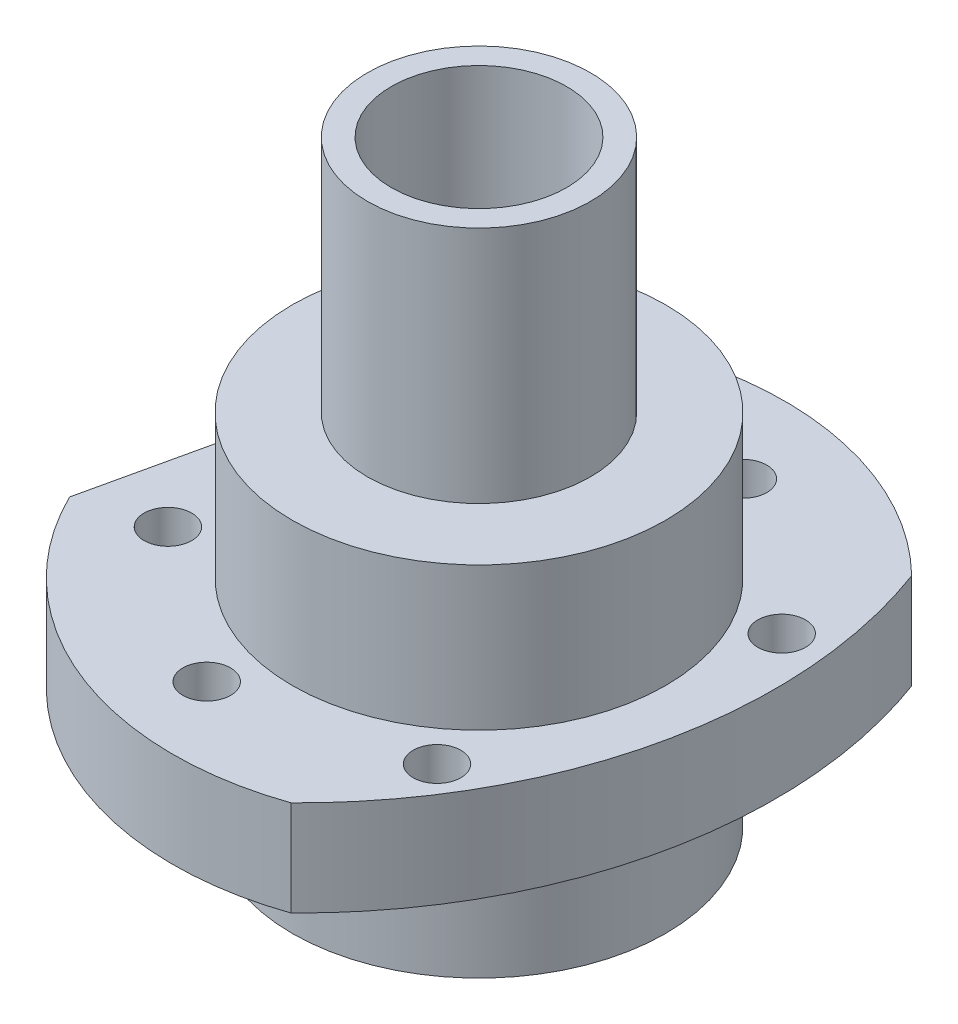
from build123d import *

# Parameters (mm, degrees)
CUT_EXTRUDE1_DEPTH = 8
SKETCH3_R          = 2
CUT_EXTRUDE2_DEPTH = 8


with BuildPart() as part:
    # Sketch1 → Revolve1 (revolve)
    with BuildSketch(Plane(origin=(0, 0, 0), x_dir=(0, 0, -1), z_dir=(1, 0, 0)), mode=Mode.PRIVATE) as revolve1_sk:
        with BuildLine():
            Line((13, 0), (16, 0))
            Line((16, 0), (16, 10))
            Line((16, 10), (26, 10))
            Line((26, 10), (26, 18))
            Line((26, 18), (16, 18))
            Line((16, 18), (16, 30))
            Line((16, 30), (9.7, 30))
            Line((9.7, 30), (9.7, 50))
            Line((9.7, 50), (7.7, 50))
            Line((7.7, 50), (7.7, 30))
            Line((7.7, 30), (7.7, 27))
            Line((7.7, 27), (13, 27))
            Line((13, 27), (13, 23))
            Line((13, 23), (13, 5))
            Line((13, 5), (13.3, 5))
            ThreePointArc((13.3, 5), (13.794974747, 4.794974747), (14, 4.3))
            Line((14, 4.3), (14, 2.7))
            ThreePointArc((14, 2.7), (13.794974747, 2.205025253), (13.3, 2))
            Line((13.3, 2), (13, 2))
            Line((13, 2), (13, 0))
        make_face()
    revolve(revolve1_sk.sketch.rotate(Axis((0, 30, -0.35), (0, -1, 0)), 180), axis=Axis((0, 30, -0.35), (0, -1, 0)))

    # Sketch2 → Cut-Extrude1 (cut)
    with BuildSketch(Plane(origin=(0, 18, 0), x_dir=(1, 0, 0), z_dir=(0, 1, 0))):
        with BuildLine():
            Line((-16.002111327, 20.39631969), (-23.028955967, -10.945560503))
            ThreePointArc((-23.028955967, -10.945560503), (-25.028671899, 5.961424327), (-16.002111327, 20.39631969))
        make_face()
        with BuildLine():
            ThreePointArc((8.459378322, -23.864900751), (25.028671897, -5.261424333), (17.987942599, 18.635415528))
            add(Edge.make_bspline(
                [(8.459378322, -23.864900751), (9.268002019, -23.07367095), (10.939810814, -21.292940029), (13.248288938, -18.332821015), (15.350621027, -15.010373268), (17.117173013, -11.497859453), (18.530932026, -7.829106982), (19.578282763, -4.039447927), (20.249138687, -0.165378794), (20.537039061, 3.755791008), (20.439211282, 7.686298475), (19.956597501, 11.588290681), (19.132877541, 15.250648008), (18.381357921, 17.574688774), (17.987942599, 18.635415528)],
                knots=[0.316752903, 0.316752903, 0.316752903, 0.316752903, 0.343759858, 0.37500793, 0.406256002, 0.437504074, 0.468752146, 0.500000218, 0.53124829, 0.562496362, 0.593744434, 0.624992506, 0.656240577, 0.683247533, 0.683247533, 0.683247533, 0.683247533], degree=3))
        make_face()
    extrude(amount=-CUT_EXTRUDE1_DEPTH, mode=Mode.SUBTRACT)

    # Sketch3 → Cut-Extrude2 (cut)
    with BuildSketch(Plane(origin=(0, 18, 0), x_dir=(1, 0, 0), z_dir=(0, 1, 0))):
        with Locations(Location((-11.758250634, 14.924595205, 0), (0, 0, 270))):
            Circle(SKETCH3_R)
        with Locations(Location((-16.739655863, -8.987987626, 0), (0, 0, 270))):
            Circle(SKETCH3_R)
        with Locations(Location((-3.874845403, -18.600687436, 0), (0, 0, 270))):
            Circle(SKETCH3_R)
        with Locations(Location((11.758250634, -14.924595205, 0), (0, 0, 270))):
            Circle(SKETCH3_R)
        with Locations(Location((16.739655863, 8.987987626, 0), (0, 0, 270))):
            Circle(SKETCH3_R)
        with Locations(Location((3.874845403, 18.600687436, 0), (0, 0, 270))):
            Circle(SKETCH3_R)
    extrude(amount=-CUT_EXTRUDE2_DEPTH, mode=Mode.SUBTRACT)


solid = part.part
